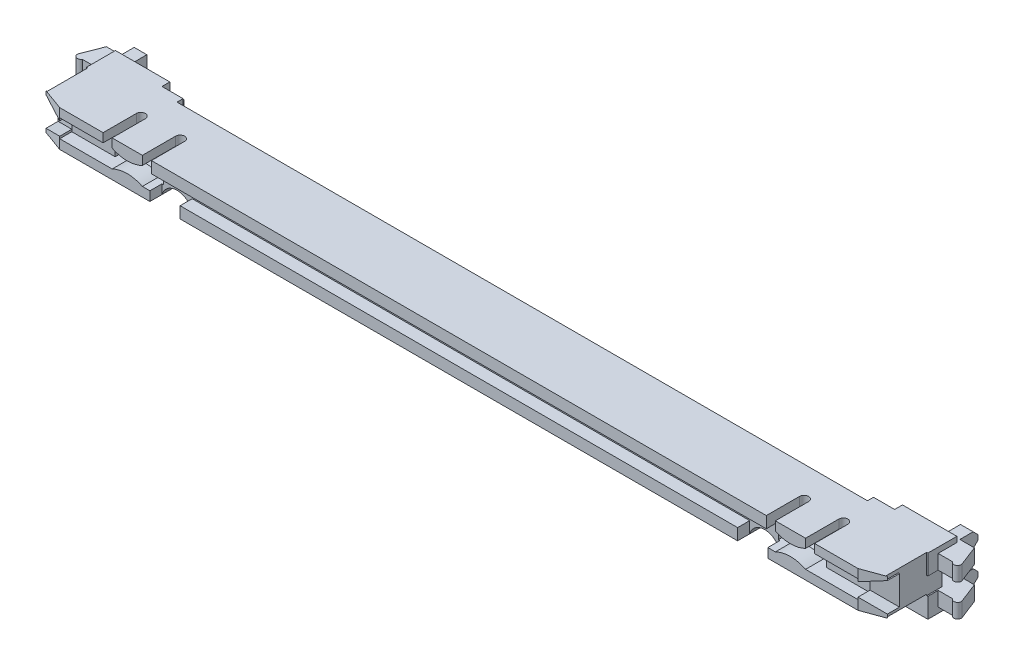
from build123d import *
from OCP.BRepFilletAPI import BRepFilletAPI_MakeChamfer

# Parameters (mm, degrees)
EXTRUDE_1_DEPTH          = 8.5
SKETCH_3_W               = 139.3
SKETCH_3_H               = 1.9
SKETCH_3_W_2             = 18.5
SKETCH_3_W_3             = 92.3
EXTRUDE_2_DEPTH          = 2
SKETCH_4_W               = 15.825
SKETCH_4_H               = 3
CUT_EXTRUDE_1_DEPTH      = 1.4
EXTRUDE_3_DEPTH          = 2.4
SKETCH_6_W               = 12.5
SKETCH_6_H               = 1.46
SKETCH_6_H_2             = 1.5
EXTRUDE_4_DEPTH          = 1
SKETCH_7_W               = 9
SKETCH_7_H               = 1.46
SKETCH_7_H_2             = 1.5
EXTRUDE_5_DEPTH          = 1.3
CHAMFER_1_SIZE           = 1.3
CHAMFER_1_SIZE2          = 3.571720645
CHAMFER_2_SIZE           = 0.8
EXTRUDE_6_DEPTH          = 1.5
CUT_EXTRUDE_2_DEPTH      = 6
CUT_EXTRUDE_5_DEPTH      = 7
CUT_EXTRUDE_5_DEPTH_BACK = 6.5
SKETCH_16_W              = 6.45
SKETCH_16_H              = 3
SKETCH_16_W_2            = 8
SKETCH_16_W_3            = 15.825
SKETCH_18_W              = 8
SKETCH_18_H              = 3
CUT_EXTRUDE_6_DEPTH      = 75.658423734
SKETCH_19_W              = 7.178279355
SKETCH_19_H              = 0.44
SKETCH_19_H_2            = 0.36
CUT_EXTRUDE_7_DEPTH      = 7
EXTRUDE_7_DEPTH          = 3
CUT_EXTRUDE_8_DEPTH      = 3
CUT_EXTRUDE_9_DEPTH      = 0.2


with BuildPart() as part:
    # Sketch 1 → Extrude 1 (new body)
    with BuildSketch(Plane.XY):
        with BuildLine():
            Line((-43.209830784, -1.25), (43.209830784, -1.25))
            ThreePointArc((43.209830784, -1.25), (44.747106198, -1.673804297), (45.850045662, -2.825477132))
            Line((45.850045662, -2.825477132), (46.449820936, -3.93710239))
            ThreePointArc((46.449820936, -3.93710239), (48.113564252, -5.191769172), (50.15, -4.75))
            Line((50.15, -4.75), (69.65, -4.75))
            Line((69.65, -4.75), (69.65, 4.75))
            Line((69.65, 4.75), (-69.65, 4.75))
            Line((-69.65, 4.75), (-69.65, -4.75))
            Line((-69.65, -4.75), (-50.15, -4.75))
            ThreePointArc((-50.15, -4.75), (-48.113564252, -5.191769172), (-46.449820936, -3.93710239))
            Line((-46.449820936, -3.93710239), (-45.850045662, -2.825477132))
            ThreePointArc((-45.850045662, -2.825477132), (-44.747106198, -1.673804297), (-43.209830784, -1.25))
        make_face()
        with BuildLine():
            Line((-47.4, -2), (-47.4, -2.5))
            ThreePointArc((-47.4, -2.5), (-48.65, -3.75), (-49.9, -2.5))
            Line((-49.9, -2.5), (-49.9, -2))
            ThreePointArc((-49.9, -2), (-48.65, -0.75), (-47.4, -2))
        make_face(mode=Mode.SUBTRACT)
        with BuildLine():
            Line((47.4, -2), (47.4, -2.5))
            ThreePointArc((47.4, -2.5), (48.65, -3.75), (49.9, -2.5))
            Line((49.9, -2.5), (49.9, -2))
            ThreePointArc((49.9, -2), (48.65, -0.75), (47.4, -2))
        make_face(mode=Mode.SUBTRACT)
    extrude(amount=EXTRUDE_1_DEPTH)

    # Sketch 3 → Extrude 2 (add)
    with BuildSketch(Plane.XY.offset(8.5)):
        with Locations((0, 3.8)):
            Rectangle(SKETCH_3_W, SKETCH_3_H)
        with Locations((-60.4, -0.3)):
            Rectangle(SKETCH_3_W_2, SKETCH_3_H)
        with Locations((60.4, -0.3)):
            Rectangle(SKETCH_3_W_2, SKETCH_3_H)
        with Locations((0, -0.3)):
            Rectangle(SKETCH_3_W_3, SKETCH_3_H)
    extrude(amount=EXTRUDE_2_DEPTH)

    # Sketch 4 → Cut-Extrude 1 (cut)
    with BuildSketch(Plane(origin=(0, 0, 0), x_dir=(-1, 0, 0), z_dir=(0, 0, -1))):
        with Locations((-8.4125, 1.75)):
            Rectangle(SKETCH_4_W, SKETCH_4_H)
        with Locations((-25.2375, 1.75)):
            Rectangle(SKETCH_4_W, SKETCH_4_H)
        with BuildLine():
            Line((-50.9, 3.29), (-67.35, 3.29))
            Line((-67.35, 3.29), (-67.35, -3.25))
            Line((-67.35, -3.25), (-50.9, -3.25))
            Line((-50.9, -3.25), (-50.9, -2))
            ThreePointArc((-50.9, -2), (-50.240990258, -0.409009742), (-48.65, 0.25))
            Line((-48.65, 0.25), (-34.15, 0.25))
            Line((-34.15, 0.25), (-34.15, 3.25))
            Line((-34.15, 3.25), (-48.9, 3.25))
            Line((-48.9, 3.25), (-48.9, 2.25))
            Line((-48.9, 2.25), (-50.9, 2.25))
            Line((-50.9, 2.25), (-50.9, 3.29))
        make_face()
        with Locations((8.4125, 1.75)):
            Rectangle(SKETCH_4_W, SKETCH_4_H)
        with Locations((25.2375, 1.75)):
            Rectangle(SKETCH_4_W, SKETCH_4_H)
        with BuildLine():
            Line((34.15, 3.25), (48.9, 3.25))
            Line((48.9, 3.25), (48.9, 2.25))
            Line((48.9, 2.25), (50.9, 2.25))
            Line((50.9, 2.25), (50.9, 3.29))
            Line((50.9, 3.29), (67.35, 3.29))
            Line((67.35, 3.29), (67.35, -3.25))
            Line((67.35, -3.25), (50.9, -3.25))
            Line((50.9, -3.25), (50.9, -2))
            ThreePointArc((50.9, -2), (50.240990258, -0.409009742), (48.65, 0.25))
            Line((48.65, 0.25), (34.15, 0.25))
            Line((34.15, 0.25), (34.15, 3.25))
        make_face()
    extrude(amount=-CUT_EXTRUDE_1_DEPTH, mode=Mode.SUBTRACT)

    # Sketch 5 → Extrude 3 (add)
    with BuildSketch(Plane(origin=(0, 3.85, 0), x_dir=(1, 0, 0), z_dir=(0, 1, 0))):
        with BuildLine():
            Line((67.35, 0), (69.65, 0))
            Line((69.65, 0), (69.65, -0.8))
            Line((69.65, -0.8), (72.0453199, -0.8))
            ThreePointArc((72.0453199, -0.8), (72.824253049, -1.04106767), (73.124276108, -0.282887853))
            Line((73.124276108, -0.282887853), (71.85, 3))
            Line((71.85, 3), (69.45, 3))
            Line((69.45, 3), (69.45, 6))
            Line((69.45, 6), (67.35, 6))
            Line((67.35, 6), (67.35, 0))
        make_face()
        with BuildLine():
            Line((-67.35, 6), (-67.35, 0))
            Line((-67.35, 0), (-69.65, 0))
            Line((-69.65, 0), (-69.65, -0.8))
            Line((-69.65, -0.8), (-72.0453199, -0.8))
            ThreePointArc((-72.0453199, -0.8), (-72.824253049, -1.04106767), (-73.124276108, -0.282887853))
            Line((-73.124276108, -0.282887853), (-71.85, 3))
            Line((-71.85, 3), (-69.45, 3))
            Line((-69.45, 3), (-69.45, 6))
            Line((-69.45, 6), (-67.35, 6))
        make_face()
    extrude_3 = extrude(amount=-EXTRUDE_3_DEPTH)

    # Mirror 1: Extrude 3 across plane
    add(extrude_3.mirror(Plane.ZX))

    # Sketch 6 → Extrude 4 (add)
    with BuildSketch(Plane(origin=(0, 0, 0), x_dir=(-1, 0, 0), z_dir=(0, 0, -1))):
        with Locations((63.4, 4.02)):
            Rectangle(SKETCH_6_W, SKETCH_6_H)
        with Locations((63.4, -4)):
            Rectangle(SKETCH_6_W, SKETCH_6_H_2)
        with Locations((-63.4, 4.02)):
            Rectangle(SKETCH_6_W, SKETCH_6_H)
        with Locations((-63.4, -4)):
            Rectangle(SKETCH_6_W, SKETCH_6_H_2)
    extrude(amount=EXTRUDE_4_DEPTH)

    # Sketch 7 → Extrude 5 (add)
    with BuildSketch(Plane(origin=(0, 0, -1), x_dir=(-1, 0, 0), z_dir=(0, 0, -1))):
        with Locations((-65.15, 4.02)):
            Rectangle(SKETCH_7_W, SKETCH_7_H)
        with Locations((-65.15, -4)):
            Rectangle(SKETCH_7_W, SKETCH_7_H_2)
        with Locations((65.15, 4.02)):
            Rectangle(SKETCH_7_W, SKETCH_7_H)
        with Locations((65.15, -4)):
            Rectangle(SKETCH_7_W, SKETCH_7_H_2)
    extrude(amount=EXTRUDE_5_DEPTH)

    # Chamfer 1: one chamfer whose edges measure the first distance from different faces: ONE call of the kernel's chamfer builder (chamfer() names one face for all edges)
    chamfer_1_edges_1 = [part.edges().sort_by_distance(p)[0] for p in [
        (69.65, 3.8, 10.5),
        (69.65, -0.3, 10.5),
        (69.65, 2.85, 9.5),
        (69.65, 1.75, 8.5),
        (69.65, 0.65, 9.5),
    ]]
    chamfer_1_side_1 = [part.faces().sort_by_distance(p)[0] for p in [
        (69.65, 0.150028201, 4.614670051),
    ]]
    chamfer_1_edges_2 = [part.edges().sort_by_distance(p)[0] for p in [
        (-69.65, -0.3, 10.5),
        (-69.65, 0.65, 9.5),
        (-69.65, 1.75, 8.5),
        (-69.65, 2.85, 9.5),
        (-69.65, 3.8, 10.5),
    ]]
    chamfer_1_side_2 = [part.faces().sort_by_distance(p)[0] for p in [
        (-69.65, 0.150028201, 4.614670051),
    ]]
    chamfer_1 = BRepFilletAPI_MakeChamfer(part.part.solid().wrapped)
    for e in chamfer_1_edges_1:
        chamfer_1.Add(CHAMFER_1_SIZE, CHAMFER_1_SIZE2, e.wrapped, chamfer_1_side_1[0].wrapped)  # the first distance lies on this face
    for e in chamfer_1_edges_2:
        chamfer_1.Add(CHAMFER_1_SIZE, CHAMFER_1_SIZE2, e.wrapped, chamfer_1_side_2[0].wrapped)  # the first distance lies on this face
    add(Compound.cast(chamfer_1.Shape()), mode=Mode.REPLACE)

    # Chamfer 2
    chamfer_2_edges = [part.edges().sort_by_distance(p)[0] for p in [
        (68.4, 1.45, -6),
        (67.35, 2.65, -6),
        (68.4, 3.85, -6),
        (-68.4, 1.45, -6),
        (-67.35, 2.65, -6),
        (-68.4, 3.85, -6),
        (67.35, -2.65, -6),
        (68.4, -3.85, -6),
        (68.4, -1.45, -6),
        (-68.4, -3.85, -6),
        (-67.35, -2.65, -6),
        (-68.4, -1.45, -6),
    ]]
    chamfer(chamfer_2_edges, length=CHAMFER_2_SIZE)

    # Sketch 9 → Extrude 6 (add, symmetric)
    with BuildSketch(Plane(origin=(0, 0, 0), x_dir=(1, 0, 0), z_dir=(0, 1, 0))):
        Polygon((-60.9, 4.2), (-60.9, -1.4), (-58.9, -1.4), (-59.577085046, 3.417710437), (-60.2, 4.2), align=None)
        Polygon((60.2, 4.2), (59.577085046, 3.417710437), (58.9, -1.4), (60.9, -1.4), (60.9, 4.2), align=None)
    extrude(amount=EXTRUDE_6_DEPTH, both=True)

    # Sketch 10 → Cut-Extrude 2 (cut)
    with BuildSketch(Plane.XY.offset(8.5)):
        with BuildLine():
            Line((-69.65, -1.25), (-51.15, -1.25))
            ThreePointArc((-51.15, -1.25), (-48.65, 0.610076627), (-46.15, -1.25))
            Line((-46.15, -1.25), (-43.209830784, -1.25))
            Line((-43.209830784, -1.25), (-43.209830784, -6.774434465))
            Line((-43.209830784, -6.774434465), (-69.65, -6.774434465))
            Line((-69.65, -6.774434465), (-69.65, -1.25))
        make_face()
        with BuildLine():
            Line((69.65, -6.774434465), (69.65, -1.25))
            Line((69.65, -1.25), (51.15, -1.25))
            ThreePointArc((51.15, -1.25), (48.65, 0.610076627), (46.15, -1.25))
            Line((46.15, -1.25), (43.209830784, -1.25))
            Line((43.209830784, -1.25), (43.209830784, -6.774434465))
            Line((43.209830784, -6.774434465), (69.65, -6.774434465))
        make_face()
    extrude(amount=-CUT_EXTRUDE_2_DEPTH, mode=Mode.SUBTRACT)

    # Sketch 16 → Cut-Extrude 5 (cut, two sides: drawn at the far end of the back side and taken through both)
    with BuildSketch(Plane(origin=(0, 0, 1.4), x_dir=(-1, 0, 0), z_dir=(0, 0, -1)).offset(-CUT_EXTRUDE_5_DEPTH_BACK)):
        with Locations((-64.125, 1.79)):
            Rectangle(SKETCH_16_W, SKETCH_16_H)
        with Locations((-54.9, 1.79)):
            Rectangle(SKETCH_16_W_2, SKETCH_16_H)
        with BuildLine():
            Line((-48.9, 1.25), (-47.4, 1.25))
            ThreePointArc((-47.4, 1.25), (-45.915848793, 0.992472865), (-44.605215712, 0.25))
            Line((-44.605215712, 0.25), (-34.15, 0.25))
            Line((-34.15, 0.25), (-34.15, 3.25))
            Line((-34.15, 3.25), (-48.9, 3.25))
            ThreePointArc((-48.9, 3.25), (-49.9, 2.25), (-48.9, 1.25))
        make_face()
        with BuildLine():
            Line((34.15, 3.25), (48.9, 3.25))
            ThreePointArc((48.9, 3.25), (49.9, 2.25), (48.9, 1.25))
            Line((48.9, 1.25), (47.4, 1.25))
            ThreePointArc((47.4, 1.25), (45.915848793, 0.992472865), (44.605215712, 0.25))
            Line((44.605215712, 0.25), (34.15, 0.25))
            Line((34.15, 0.25), (34.15, 3.25))
        make_face()
        with Locations((54.9, 1.79)):
            Rectangle(SKETCH_16_W_2, SKETCH_16_H)
        with Locations((64.125, 1.79)):
            Rectangle(SKETCH_16_W, SKETCH_16_H)
        with Locations((-25.2375, 1.75)):
            Rectangle(SKETCH_16_W_3, SKETCH_16_H)
        with Locations((-8.4125, 1.75)):
            Rectangle(SKETCH_16_W_3, SKETCH_16_H)
        with Locations((8.4125, 1.75)):
            Rectangle(SKETCH_16_W_3, SKETCH_16_H)
        with Locations((25.2375, 1.75)):
            Rectangle(SKETCH_16_W_3, SKETCH_16_H)
    extrude(amount=CUT_EXTRUDE_5_DEPTH + CUT_EXTRUDE_5_DEPTH_BACK, mode=Mode.SUBTRACT)

    # Sketch 18 → Cut-Extrude 6 (cut, through all)
    with BuildSketch(Plane(origin=(0, 0, 7.9), x_dir=(-1, 0, 0), z_dir=(0, 0, -1))):
        with Locations((-54.9, 1.79)):
            Rectangle(SKETCH_18_W, SKETCH_18_H)
        with Locations((54.9, 1.79)):
            Rectangle(SKETCH_18_W, SKETCH_18_H)
    extrude(amount=-CUT_EXTRUDE_6_DEPTH, mode=Mode.SUBTRACT)

    # Sketch 19 → Cut-Extrude 7 (cut)
    with BuildSketch(Plane.XY.offset(8.5)):
        with Locations((-62.489139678, 3.07)):
            Rectangle(SKETCH_19_W, SKETCH_19_H)
        with Locations((-62.489139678, 0.47)):
            Rectangle(SKETCH_19_W, SKETCH_19_H_2)
        with Locations((62.489139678, 3.07)):
            Rectangle(SKETCH_19_W, SKETCH_19_H)
        with Locations((62.489139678, 0.47)):
            Rectangle(SKETCH_19_W, SKETCH_19_H_2)
    extrude(amount=CUT_EXTRUDE_7_DEPTH, mode=Mode.SUBTRACT)

    # Sketch 20 → Extrude 7 (add)
    with BuildSketch(Plane.XY.offset(10.5)):
        with BuildLine():
            Line((52.4, 3.29), (57.4, 3.29))
            ThreePointArc((57.4, 3.29), (54.9, 2.699830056), (52.4, 3.29))
        make_face()
        with BuildLine():
            Line((57.4, 0.29), (52.4, 0.29))
            ThreePointArc((52.4, 0.29), (54.9, 0.880169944), (57.4, 0.29))
        make_face()
        with BuildLine():
            Line((-57.4, 0.29), (-52.4, 0.29))
            ThreePointArc((-52.4, 0.29), (-54.9, 0.880169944), (-57.4, 0.29))
        make_face()
        with BuildLine():
            Line((-52.4, 3.29), (-57.4, 3.29))
            ThreePointArc((-57.4, 3.29), (-54.9, 2.699830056), (-52.4, 3.29))
        make_face()
    extrude(amount=-EXTRUDE_7_DEPTH)

    # Sketch 21 → Cut-Extrude 8 (cut)
    with BuildSketch(Plane(origin=(0, 4.75, 0), x_dir=(1, 0, 0), z_dir=(0, 1, 0))):
        with BuildLine():
            Line((-58.9, -10.5), (-58.9, -5))
            ThreePointArc((-58.9, -5), (-58.15, -4.25), (-57.4, -5))
            Line((-57.4, -5), (-57.4, -10.5))
            ThreePointArc((-57.4, -10.5), (-58.15, -11.25), (-58.9, -10.5))
        make_face()
        with BuildLine():
            Line((-52.4, -10.5), (-52.4, -5))
            ThreePointArc((-52.4, -5), (-51.65, -4.25), (-50.9, -5))
            Line((-50.9, -5), (-50.9, -10.5))
            ThreePointArc((-50.9, -10.5), (-51.65, -11.25), (-52.4, -10.5))
        make_face()
        with BuildLine():
            Line((58.9, -10.5), (58.9, -5))
            ThreePointArc((58.9, -5), (58.15, -4.25), (57.4, -5))
            Line((57.4, -5), (57.4, -10.5))
            ThreePointArc((57.4, -10.5), (58.15, -11.25), (58.9, -10.5))
        make_face()
        with BuildLine():
            Line((52.4, -10.5), (52.4, -5))
            ThreePointArc((52.4, -5), (51.65, -4.25), (50.9, -5))
            Line((50.9, -5), (50.9, -10.5))
            ThreePointArc((50.9, -10.5), (51.65, -11.25), (52.4, -10.5))
        make_face()
    extrude(amount=-CUT_EXTRUDE_8_DEPTH, mode=Mode.SUBTRACT)

    # Sketch 22 → Cut-Extrude 9 (cut)
    with BuildSketch(Plane(origin=(69.65, 0, 0), x_dir=(0, 0, -1), z_dir=(1, 0, 0))):
        Polygon((0, 1.45), (0, -1.45), (-2.5, -1.45), (-2.5, -1.25), (-9.2, -1.25), (-9.2, -0.65), (-7.2, -0.65), (-7.2, 4.15), (-9.2, 4.15), (-9.2, 4.75), (-2.5, 4.75), (-2.5, 1.45), align=None)
    cut_extrude_9 = extrude(amount=-CUT_EXTRUDE_9_DEPTH, mode=Mode.SUBTRACT)

    # Mirror 2: Cut-Extrude 9 across plane
    add(cut_extrude_9.mirror(Plane(origin=(0, 0, 0), x_dir=(0, 0, 1), z_dir=(1, 0, 0))), mode=Mode.SUBTRACT)


solid = part.part
